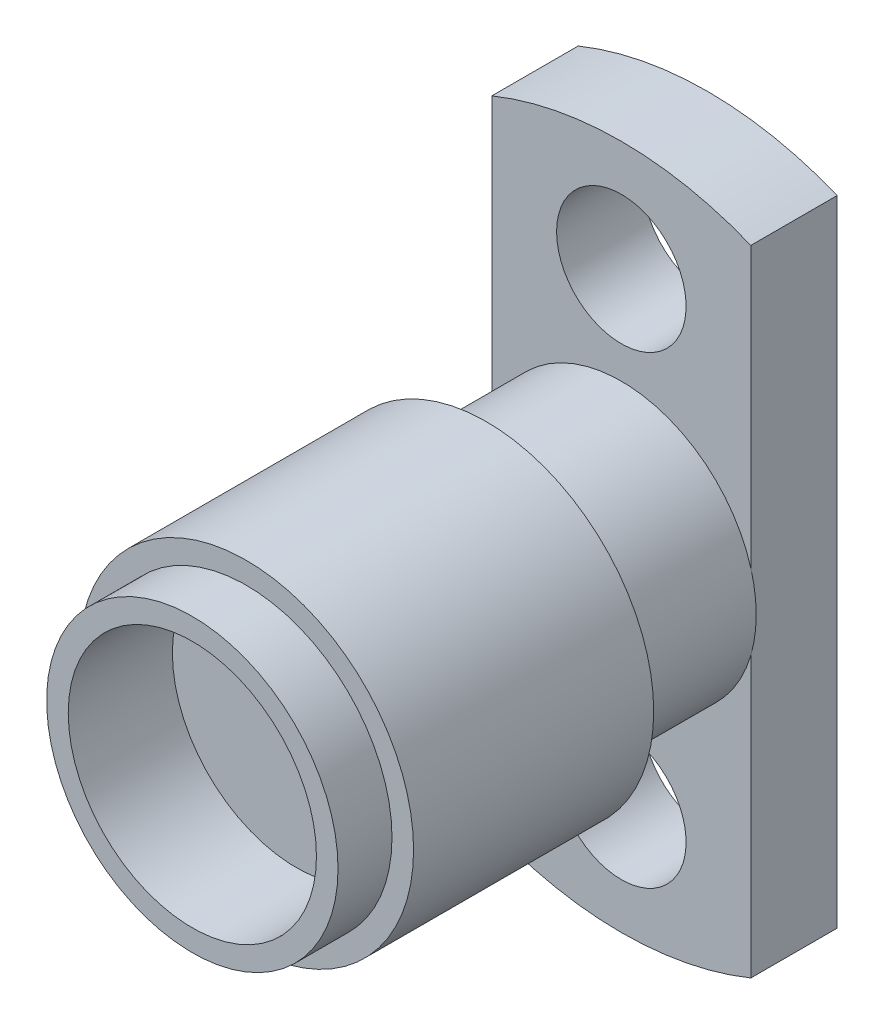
from build123d import *

# Parameters (mm, degrees)
EXTRUDE_1_DEPTH     = 1.6
SKETCH_3_R          = 2.5
EXTRUDE_2_DEPTH     = 2.5
SKETCH_4_R          = 3.1
EXTRUDE_3_DEPTH     = 4.45
SKETCH_5_R          = 2.7
EXTRUDE_4_DEPTH     = 1
SKETCH_6_R          = 0.175
CUT_EXTRUDE_1_DEPTH = 2
SKETCH_7_R          = 1.2
CUT_EXTRUDE_2_DEPTH = 2
SKETCH_8_R          = 2.3
CUT_EXTRUDE_3_DEPTH = 1.93
CUT_EXTRUDE_START   = -2.5
SKETCH_9_R          = 0.175
CUT_EXTRUDE_4_DEPTH = 2.5


with BuildPart() as part:
    # Sketch 2 → Extrude 1 (new body)
    with BuildSketch(Plane.XY):
        with BuildLine():
            Line((17.794472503, 18.674581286), (17.794472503, 6.91660527))
            ThreePointArc((17.794472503, 6.91660527), (15.394472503, 6.445593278), (12.994472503, 6.91660527))
            Line((12.994472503, 6.91660527), (12.994472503, 18.674581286))
            ThreePointArc((12.994472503, 18.674581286), (15.394472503, 19.145593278), (17.794472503, 18.674581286))
        make_face()
    extrude(amount=EXTRUDE_1_DEPTH)

    # Sketch 3 → Extrude 2 (add)
    with BuildSketch(Plane.XY.offset(1.6)):
        with Locations(Location((15.394472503, 12.795593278, 0), (0, 0, 163.739795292))):
            Circle(SKETCH_3_R)
    extrude(amount=EXTRUDE_2_DEPTH)

    # Sketch 4 → Extrude 3 (add)
    with BuildSketch(Plane.XY.offset(4.1)):
        with Locations((15.394472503, 12.795593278)):
            Circle(SKETCH_4_R)
    extrude(amount=EXTRUDE_3_DEPTH)

    # Sketch 5 → Extrude 4 (add)
    with BuildSketch(Plane.XY.offset(8.55)):
        with Locations((15.394472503, 12.795593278)):
            Circle(SKETCH_5_R)
    extrude(amount=EXTRUDE_4_DEPTH)

    # Sketch 6 → Cut-Extrude 1 (cut)
    with BuildSketch(Plane(origin=(0, 0, 0), x_dir=(-1, 0, 0), z_dir=(0, 0, -1))):
        with Locations((-15.394472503, 12.795593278)):
            Circle(SKETCH_6_R)
    extrude(amount=-CUT_EXTRUDE_1_DEPTH, mode=Mode.SUBTRACT)

    # Sketch 7 → Cut-Extrude 2 (cut)
    with BuildSketch(Plane(origin=(0, 0, 0), x_dir=(-1, 0, 0), z_dir=(0, 0, -1))):
        with Locations((-15.394472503, 17.095593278)):
            Circle(SKETCH_7_R)
        with Locations((-15.394472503, 8.495593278)):
            Circle(SKETCH_7_R)
    extrude(amount=-CUT_EXTRUDE_2_DEPTH, mode=Mode.SUBTRACT)

    # Sketch 8 → Cut-Extrude 3 (cut)
    with BuildSketch(Plane.XY.offset(9.55)):
        with Locations((15.394472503, 12.795593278)):
            Circle(SKETCH_8_R)
    extrude(amount=-CUT_EXTRUDE_3_DEPTH, mode=Mode.SUBTRACT)

    # Sketch 9 → Cut-Extrude 4 (cut)
    with BuildSketch(Plane.XY.offset(7.62).offset(CUT_EXTRUDE_START)):
        with Locations(Location((15.394472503, 12.795593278, 0), (0, 0, 180))):
            Circle(SKETCH_9_R)
    extrude(amount=CUT_EXTRUDE_4_DEPTH, mode=Mode.SUBTRACT)


solid = part.part
